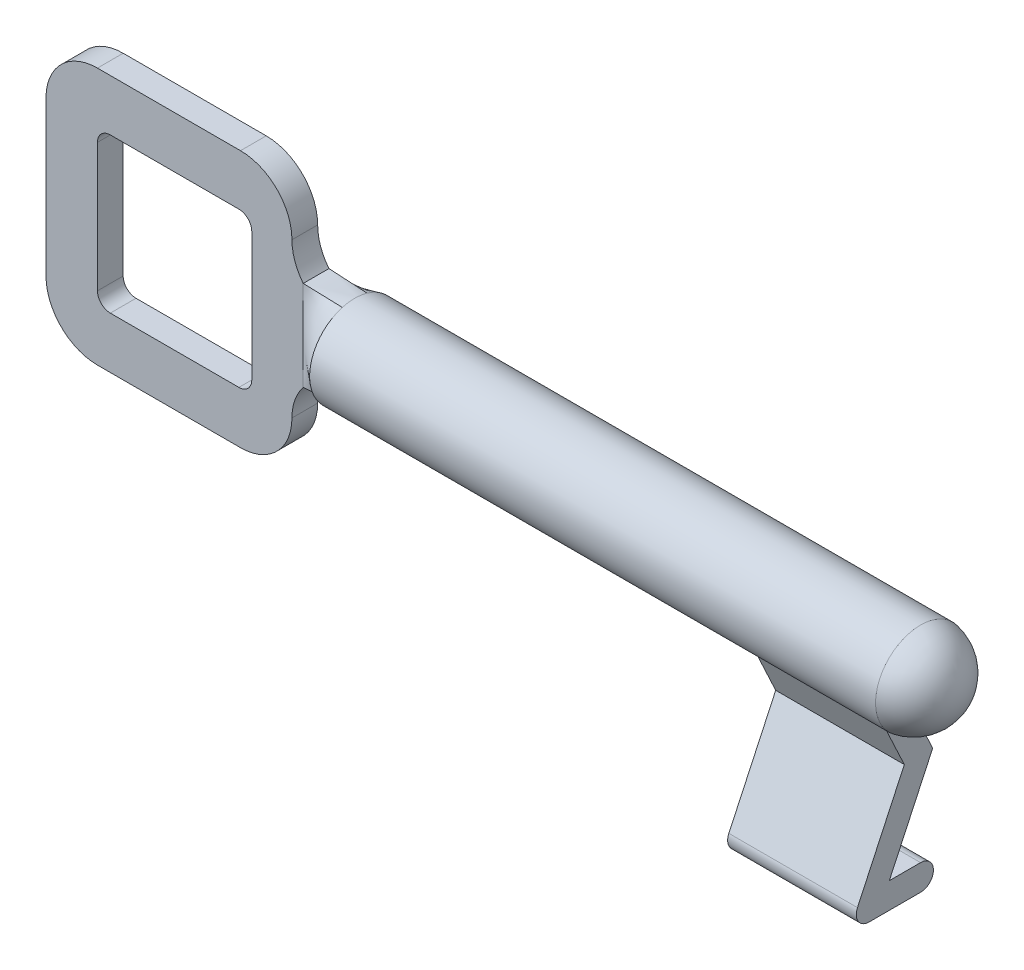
ISO-10303-21;
HEADER;
FILE_DESCRIPTION(('STEP AP214'),'2;1');
FILE_NAME('part.step','',(''),(''),'','','');
FILE_SCHEMA(('AUTOMOTIVE_DESIGN { 1 0 10303 214 1 1 1 1 }'));
ENDSEC;
DATA;
#1=APPLICATION_CONTEXT('core data for automotive mechanical design processes');
#2=APPLICATION_PROTOCOL_DEFINITION('international standard','automotive_design',2000,#1);
#3=PRODUCT_CONTEXT('',#1,'mechanical');
#4=PRODUCT('Part','Part','',(#3));
#5=PRODUCT_RELATED_PRODUCT_CATEGORY('part','',(#4));
#6=PRODUCT_DEFINITION_FORMATION('','',#4);
#7=PRODUCT_DEFINITION_CONTEXT('part definition',#1,'design');
#8=PRODUCT_DEFINITION('design','',#6,#7);
#9=PRODUCT_DEFINITION_SHAPE('','',#8);
#10=(LENGTH_UNIT() NAMED_UNIT(*) SI_UNIT(.MILLI.,.METRE.));
#11=(NAMED_UNIT(*) PLANE_ANGLE_UNIT() SI_UNIT($,.RADIAN.));
#12=(NAMED_UNIT(*) SI_UNIT($,.STERADIAN.) SOLID_ANGLE_UNIT());
#13=UNCERTAINTY_MEASURE_WITH_UNIT(LENGTH_MEASURE(1.E-05),#10,'distance_accuracy_value','');
#14=(GEOMETRIC_REPRESENTATION_CONTEXT(3) GLOBAL_UNCERTAINTY_ASSIGNED_CONTEXT((#13)) GLOBAL_UNIT_ASSIGNED_CONTEXT((#10,
#11,#12)) REPRESENTATION_CONTEXT('',''));
#15=CARTESIAN_POINT('',(0.,0.,0.));
#16=DIRECTION('',(0.,0.,1.));
#17=DIRECTION('',(1.,0.,0.));
#18=AXIS2_PLACEMENT_3D('',#15,#16,#17);
#19=CARTESIAN_POINT('',(4.,6.,1.));
#20=DIRECTION('',(0.,0.,-1.));
#21=DIRECTION('',(-1.,0.,0.));
#22=AXIS2_PLACEMENT_3D('',#19,#20,#21);
#23=PLANE('',#22);
#24=CARTESIAN_POINT('',(4.,6.,1.));
#25=DIRECTION('',(0.,0.,1.));
#26=DIRECTION('',(-1.,0.,0.));
#27=AXIS2_PLACEMENT_3D('',#24,#25,#26);
#28=CIRCLE('',#27,4.);
#29=CARTESIAN_POINT('',(4.,10.,1.));
#30=VERTEX_POINT('',#29);
#31=CARTESIAN_POINT('',(0.,6.,1.));
#32=VERTEX_POINT('',#31);
#33=EDGE_CURVE('E517',#30,#32,#28,.T.);
#34=ORIENTED_EDGE('',*,*,#33,.T.);
#35=DIRECTION('',(0.,-1.,0.));
#36=VECTOR('',#35,1.);
#37=CARTESIAN_POINT('',(0.,6.,1.));
#38=LINE('',#37,#36);
#39=CARTESIAN_POINT('',(0.,-6.,1.));
#40=VERTEX_POINT('',#39);
#41=EDGE_CURVE('E622',#32,#40,#38,.T.);
#42=ORIENTED_EDGE('',*,*,#41,.T.);
#43=CARTESIAN_POINT('',(4.,-6.,1.));
#44=DIRECTION('',(0.,0.,1.));
#45=DIRECTION('',(1.,0.,0.));
#46=AXIS2_PLACEMENT_3D('',#43,#44,#45);
#47=CIRCLE('',#46,4.);
#48=CARTESIAN_POINT('',(4.,-10.,1.));
#49=VERTEX_POINT('',#48);
#50=EDGE_CURVE('E498',#40,#49,#47,.T.);
#51=ORIENTED_EDGE('',*,*,#50,.T.);
#52=DIRECTION('',(1.,0.,0.));
#53=VECTOR('',#52,1.);
#54=CARTESIAN_POINT('',(4.,-10.,1.));
#55=LINE('',#54,#53);
#56=CARTESIAN_POINT('',(15.1224989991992,-10.,1.));
#57=VERTEX_POINT('',#56);
#58=EDGE_CURVE('E624',#49,#57,#55,.T.);
#59=ORIENTED_EDGE('',*,*,#58,.T.);
#60=CARTESIAN_POINT('',(15.1224989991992,-6.,1.));
#61=DIRECTION('',(0.,0.,1.));
#62=DIRECTION('',(1.,0.,0.));
#63=AXIS2_PLACEMENT_3D('',#60,#61,#62);
#64=CIRCLE('',#63,4.);
#65=CARTESIAN_POINT('',(19.1224989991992,-6.,1.));
#66=VERTEX_POINT('',#65);
#67=EDGE_CURVE('E543',#57,#66,#64,.T.);
#68=ORIENTED_EDGE('',*,*,#67,.T.);
#69=CARTESIAN_POINT('',(23.1224989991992,-6.,1.));
#70=DIRECTION('',(0.,0.,-1.));
#71=DIRECTION('',(-1.,0.,0.));
#72=AXIS2_PLACEMENT_3D('',#69,#70,#71);
#73=CIRCLE('',#72,4.);
#74=CARTESIAN_POINT('',(20.,-3.5,1.));
#75=VERTEX_POINT('',#74);
#76=EDGE_CURVE('E540',#66,#75,#73,.T.);
#77=ORIENTED_EDGE('',*,*,#76,.T.);
#78=DIRECTION('',(0.,1.,0.));
#79=VECTOR('',#78,1.);
#80=CARTESIAN_POINT('',(20.,6.,1.));
#81=LINE('',#80,#79);
#82=CARTESIAN_POINT('',(20.,3.5,1.));
#83=VERTEX_POINT('',#82);
#84=EDGE_CURVE('E542',#75,#83,#81,.T.);
#85=ORIENTED_EDGE('',*,*,#84,.T.);
#86=CARTESIAN_POINT('',(23.1224989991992,6.,1.));
#87=DIRECTION('',(0.,0.,-1.));
#88=DIRECTION('',(1.,0.,0.));
#89=AXIS2_PLACEMENT_3D('',#86,#87,#88);
#90=CIRCLE('',#89,4.);
#91=CARTESIAN_POINT('',(19.1224989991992,6.,1.));
#92=VERTEX_POINT('',#91);
#93=EDGE_CURVE('E544',#83,#92,#90,.T.);
#94=ORIENTED_EDGE('',*,*,#93,.T.);
#95=CARTESIAN_POINT('',(15.1224989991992,6.,1.));
#96=DIRECTION('',(0.,0.,1.));
#97=DIRECTION('',(-1.,0.,0.));
#98=AXIS2_PLACEMENT_3D('',#95,#96,#97);
#99=CIRCLE('',#98,4.);
#100=CARTESIAN_POINT('',(15.1224989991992,10.,1.));
#101=VERTEX_POINT('',#100);
#102=EDGE_CURVE('E546',#92,#101,#99,.T.);
#103=ORIENTED_EDGE('',*,*,#102,.T.);
#104=DIRECTION('',(-1.,0.,0.));
#105=VECTOR('',#104,1.);
#106=CARTESIAN_POINT('',(4.,10.,1.));
#107=LINE('',#106,#105);
#108=EDGE_CURVE('E522',#101,#30,#107,.T.);
#109=ORIENTED_EDGE('',*,*,#108,.T.);
#110=EDGE_LOOP('',(#34,#42,#51,#59,#68,#77,#85,#94,#103,#109));
#111=FACE_BOUND('',#110,.T.);
#112=CARTESIAN_POINT('',(5.,-5.,1.));
#113=DIRECTION('',(0.,0.,1.));
#114=DIRECTION('',(-1.,0.,0.));
#115=AXIS2_PLACEMENT_3D('',#112,#113,#114);
#116=CIRCLE('',#115,1.);
#117=CARTESIAN_POINT('',(4.,-5.,1.));
#118=VERTEX_POINT('',#117);
#119=CARTESIAN_POINT('',(5.,-6.,1.));
#120=VERTEX_POINT('',#119);
#121=EDGE_CURVE('E562',#118,#120,#116,.T.);
#122=ORIENTED_EDGE('',*,*,#121,.F.);
#123=DIRECTION('',(0.,-1.,0.));
#124=VECTOR('',#123,1.);
#125=CARTESIAN_POINT('',(4.,-5.,1.));
#126=LINE('',#125,#124);
#127=CARTESIAN_POINT('',(4.,5.,1.));
#128=VERTEX_POINT('',#127);
#129=EDGE_CURVE('E634',#128,#118,#126,.T.);
#130=ORIENTED_EDGE('',*,*,#129,.F.);
#131=CARTESIAN_POINT('',(5.,5.,1.));
#132=DIRECTION('',(0.,0.,1.));
#133=DIRECTION('',(-1.,0.,0.));
#134=AXIS2_PLACEMENT_3D('',#131,#132,#133);
#135=CIRCLE('',#134,1.);
#136=CARTESIAN_POINT('',(5.,6.,1.));
#137=VERTEX_POINT('',#136);
#138=EDGE_CURVE('E687',#137,#128,#135,.T.);
#139=ORIENTED_EDGE('',*,*,#138,.F.);
#140=DIRECTION('',(-1.,0.,0.));
#141=VECTOR('',#140,1.);
#142=CARTESIAN_POINT('',(5.,6.,1.));
#143=LINE('',#142,#141);
#144=CARTESIAN_POINT('',(15.,6.,1.));
#145=VERTEX_POINT('',#144);
#146=EDGE_CURVE('E685',#145,#137,#143,.T.);
#147=ORIENTED_EDGE('',*,*,#146,.F.);
#148=CARTESIAN_POINT('',(15.,5.,1.));
#149=DIRECTION('',(0.,0.,1.));
#150=DIRECTION('',(-1.,0.,0.));
#151=AXIS2_PLACEMENT_3D('',#148,#149,#150);
#152=CIRCLE('',#151,1.);
#153=CARTESIAN_POINT('',(16.,5.,1.));
#154=VERTEX_POINT('',#153);
#155=EDGE_CURVE('E692',#154,#145,#152,.T.);
#156=ORIENTED_EDGE('',*,*,#155,.F.);
#157=DIRECTION('',(0.,1.,0.));
#158=VECTOR('',#157,1.);
#159=CARTESIAN_POINT('',(16.,5.,1.));
#160=LINE('',#159,#158);
#161=CARTESIAN_POINT('',(16.,-5.,1.));
#162=VERTEX_POINT('',#161);
#163=EDGE_CURVE('E694',#162,#154,#160,.T.);
#164=ORIENTED_EDGE('',*,*,#163,.F.);
#165=CARTESIAN_POINT('',(15.,-5.,1.));
#166=DIRECTION('',(0.,0.,1.));
#167=DIRECTION('',(-1.,0.,0.));
#168=AXIS2_PLACEMENT_3D('',#165,#166,#167);
#169=CIRCLE('',#168,1.);
#170=CARTESIAN_POINT('',(15.,-6.,1.));
#171=VERTEX_POINT('',#170);
#172=EDGE_CURVE('E639',#171,#162,#169,.T.);
#173=ORIENTED_EDGE('',*,*,#172,.F.);
#174=DIRECTION('',(1.,0.,0.));
#175=VECTOR('',#174,1.);
#176=CARTESIAN_POINT('',(5.,-6.,1.));
#177=LINE('',#176,#175);
#178=EDGE_CURVE('E636',#120,#171,#177,.T.);
#179=ORIENTED_EDGE('',*,*,#178,.F.);
#180=EDGE_LOOP('',(#122,#130,#139,#147,#156,#164,#173,#179));
#181=FACE_BOUND('',#180,.T.);
#182=ADVANCED_FACE('F59',(#111,#181),#23,.F.);
#183=CARTESIAN_POINT('',(4.,6.,-1.));
#184=DIRECTION('',(0.,0.,-1.));
#185=DIRECTION('',(-1.,0.,0.));
#186=AXIS2_PLACEMENT_3D('',#183,#184,#185);
#187=PLANE('',#186);
#188=CARTESIAN_POINT('',(4.,6.,-1.));
#189=DIRECTION('',(0.,0.,1.));
#190=DIRECTION('',(-1.,0.,0.));
#191=AXIS2_PLACEMENT_3D('',#188,#189,#190);
#192=CIRCLE('',#191,4.);
#193=CARTESIAN_POINT('',(4.,10.,-1.));
#194=VERTEX_POINT('',#193);
#195=CARTESIAN_POINT('',(0.,6.,-1.));
#196=VERTEX_POINT('',#195);
#197=EDGE_CURVE('E494',#194,#196,#192,.T.);
#198=ORIENTED_EDGE('',*,*,#197,.F.);
#199=DIRECTION('',(-1.,0.,0.));
#200=VECTOR('',#199,1.);
#201=CARTESIAN_POINT('',(4.,10.,-1.));
#202=LINE('',#201,#200);
#203=CARTESIAN_POINT('',(15.1224989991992,10.,-1.));
#204=VERTEX_POINT('',#203);
#205=EDGE_CURVE('E514',#204,#194,#202,.T.);
#206=ORIENTED_EDGE('',*,*,#205,.F.);
#207=CARTESIAN_POINT('',(15.1224989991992,6.,-1.));
#208=DIRECTION('',(0.,0.,1.));
#209=DIRECTION('',(-1.,0.,0.));
#210=AXIS2_PLACEMENT_3D('',#207,#208,#209);
#211=CIRCLE('',#210,4.);
#212=CARTESIAN_POINT('',(19.1224989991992,6.,-1.));
#213=VERTEX_POINT('',#212);
#214=EDGE_CURVE('E512',#213,#204,#211,.T.);
#215=ORIENTED_EDGE('',*,*,#214,.F.);
#216=CARTESIAN_POINT('',(23.1224989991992,6.,-1.));
#217=DIRECTION('',(0.,0.,-1.));
#218=DIRECTION('',(1.,0.,0.));
#219=AXIS2_PLACEMENT_3D('',#216,#217,#218);
#220=CIRCLE('',#219,4.);
#221=CARTESIAN_POINT('',(20.,3.5,-1.));
#222=VERTEX_POINT('',#221);
#223=EDGE_CURVE('E515',#222,#213,#220,.T.);
#224=ORIENTED_EDGE('',*,*,#223,.F.);
#225=DIRECTION('',(0.,1.,0.));
#226=VECTOR('',#225,1.);
#227=CARTESIAN_POINT('',(20.,6.,-1.));
#228=LINE('',#227,#226);
#229=CARTESIAN_POINT('',(20.,-3.5,-1.));
#230=VERTEX_POINT('',#229);
#231=EDGE_CURVE('E539',#230,#222,#228,.T.);
#232=ORIENTED_EDGE('',*,*,#231,.F.);
#233=CARTESIAN_POINT('',(23.1224989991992,-6.,-1.));
#234=DIRECTION('',(0.,0.,-1.));
#235=DIRECTION('',(-1.,0.,0.));
#236=AXIS2_PLACEMENT_3D('',#233,#234,#235);
#237=CIRCLE('',#236,4.);
#238=CARTESIAN_POINT('',(19.1224989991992,-6.,-1.));
#239=VERTEX_POINT('',#238);
#240=EDGE_CURVE('E511',#239,#230,#237,.T.);
#241=ORIENTED_EDGE('',*,*,#240,.F.);
#242=CARTESIAN_POINT('',(15.1224989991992,-6.,-1.));
#243=DIRECTION('',(0.,0.,1.));
#244=DIRECTION('',(1.,0.,0.));
#245=AXIS2_PLACEMENT_3D('',#242,#243,#244);
#246=CIRCLE('',#245,4.);
#247=CARTESIAN_POINT('',(15.1224989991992,-10.,-1.));
#248=VERTEX_POINT('',#247);
#249=EDGE_CURVE('E506',#248,#239,#246,.T.);
#250=ORIENTED_EDGE('',*,*,#249,.F.);
#251=DIRECTION('',(1.,0.,0.));
#252=VECTOR('',#251,1.);
#253=CARTESIAN_POINT('',(4.,-10.,-1.));
#254=LINE('',#253,#252);
#255=CARTESIAN_POINT('',(4.,-10.,-1.));
#256=VERTEX_POINT('',#255);
#257=EDGE_CURVE('E504',#256,#248,#254,.T.);
#258=ORIENTED_EDGE('',*,*,#257,.F.);
#259=CARTESIAN_POINT('',(4.,-6.,-1.));
#260=DIRECTION('',(0.,0.,1.));
#261=DIRECTION('',(1.,0.,0.));
#262=AXIS2_PLACEMENT_3D('',#259,#260,#261);
#263=CIRCLE('',#262,4.);
#264=CARTESIAN_POINT('',(0.,-6.,-1.));
#265=VERTEX_POINT('',#264);
#266=EDGE_CURVE('E493',#265,#256,#263,.T.);
#267=ORIENTED_EDGE('',*,*,#266,.F.);
#268=DIRECTION('',(0.,-1.,0.));
#269=VECTOR('',#268,1.);
#270=CARTESIAN_POINT('',(0.,6.,-1.));
#271=LINE('',#270,#269);
#272=EDGE_CURVE('E486',#196,#265,#271,.T.);
#273=ORIENTED_EDGE('',*,*,#272,.F.);
#274=EDGE_LOOP('',(#198,#206,#215,#224,#232,#241,#250,#258,#267,#273));
#275=FACE_BOUND('',#274,.T.);
#276=DIRECTION('',(0.,-1.,0.));
#277=VECTOR('',#276,1.);
#278=CARTESIAN_POINT('',(4.,-5.,-1.));
#279=LINE('',#278,#277);
#280=CARTESIAN_POINT('',(4.,5.,-1.));
#281=VERTEX_POINT('',#280);
#282=CARTESIAN_POINT('',(4.,-5.,-1.));
#283=VERTEX_POINT('',#282);
#284=EDGE_CURVE('E638',#281,#283,#279,.T.);
#285=ORIENTED_EDGE('',*,*,#284,.T.);
#286=CARTESIAN_POINT('',(5.,-5.,-1.));
#287=DIRECTION('',(0.,0.,1.));
#288=DIRECTION('',(-1.,0.,0.));
#289=AXIS2_PLACEMENT_3D('',#286,#287,#288);
#290=CIRCLE('',#289,1.);
#291=CARTESIAN_POINT('',(5.,-6.,-1.));
#292=VERTEX_POINT('',#291);
#293=EDGE_CURVE('E586',#283,#292,#290,.T.);
#294=ORIENTED_EDGE('',*,*,#293,.T.);
#295=DIRECTION('',(1.,0.,0.));
#296=VECTOR('',#295,1.);
#297=CARTESIAN_POINT('',(5.,-6.,-1.));
#298=LINE('',#297,#296);
#299=CARTESIAN_POINT('',(15.,-6.,-1.));
#300=VERTEX_POINT('',#299);
#301=EDGE_CURVE('E674',#292,#300,#298,.T.);
#302=ORIENTED_EDGE('',*,*,#301,.T.);
#303=CARTESIAN_POINT('',(15.,-5.,-1.));
#304=DIRECTION('',(0.,0.,1.));
#305=DIRECTION('',(-1.,0.,0.));
#306=AXIS2_PLACEMENT_3D('',#303,#304,#305);
#307=CIRCLE('',#306,1.);
#308=CARTESIAN_POINT('',(16.,-5.,-1.));
#309=VERTEX_POINT('',#308);
#310=EDGE_CURVE('E664',#300,#309,#307,.T.);
#311=ORIENTED_EDGE('',*,*,#310,.T.);
#312=DIRECTION('',(0.,1.,0.));
#313=VECTOR('',#312,1.);
#314=CARTESIAN_POINT('',(16.,5.,-1.));
#315=LINE('',#314,#313);
#316=CARTESIAN_POINT('',(16.,5.,-1.));
#317=VERTEX_POINT('',#316);
#318=EDGE_CURVE('E668',#309,#317,#315,.T.);
#319=ORIENTED_EDGE('',*,*,#318,.T.);
#320=CARTESIAN_POINT('',(15.,5.,-1.));
#321=DIRECTION('',(0.,0.,1.));
#322=DIRECTION('',(-1.,0.,0.));
#323=AXIS2_PLACEMENT_3D('',#320,#321,#322);
#324=CIRCLE('',#323,1.);
#325=CARTESIAN_POINT('',(15.,6.,-1.));
#326=VERTEX_POINT('',#325);
#327=EDGE_CURVE('E672',#317,#326,#324,.T.);
#328=ORIENTED_EDGE('',*,*,#327,.T.);
#329=DIRECTION('',(-1.,0.,0.));
#330=VECTOR('',#329,1.);
#331=CARTESIAN_POINT('',(5.,6.,-1.));
#332=LINE('',#331,#330);
#333=CARTESIAN_POINT('',(5.,6.,-1.));
#334=VERTEX_POINT('',#333);
#335=EDGE_CURVE('E645',#326,#334,#332,.T.);
#336=ORIENTED_EDGE('',*,*,#335,.T.);
#337=CARTESIAN_POINT('',(5.,5.,-1.));
#338=DIRECTION('',(0.,0.,1.));
#339=DIRECTION('',(-1.,0.,0.));
#340=AXIS2_PLACEMENT_3D('',#337,#338,#339);
#341=CIRCLE('',#340,1.);
#342=EDGE_CURVE('E641',#334,#281,#341,.T.);
#343=ORIENTED_EDGE('',*,*,#342,.T.);
#344=EDGE_LOOP('',(#285,#294,#302,#311,#319,#328,#336,#343));
#345=FACE_BOUND('',#344,.T.);
#346=ADVANCED_FACE('F447',(#275,#345),#187,.T.);
#347=CARTESIAN_POINT('',(4.,6.,1.));
#348=DIRECTION('',(0.,0.,-1.));
#349=DIRECTION('',(-1.,0.,0.));
#350=AXIS2_PLACEMENT_3D('',#347,#348,#349);
#351=CYLINDRICAL_SURFACE('',#350,4.);
#352=ORIENTED_EDGE('',*,*,#197,.T.);
#353=DIRECTION('',(0.,0.,-1.));
#354=VECTOR('',#353,1.);
#355=CARTESIAN_POINT('',(0.,6.,1.));
#356=LINE('',#355,#354);
#357=EDGE_CURVE('E12',#32,#196,#356,.T.);
#358=ORIENTED_EDGE('',*,*,#357,.F.);
#359=ORIENTED_EDGE('',*,*,#33,.F.);
#360=DIRECTION('',(0.,0.,-1.));
#361=VECTOR('',#360,1.);
#362=CARTESIAN_POINT('',(4.,10.,1.));
#363=LINE('',#362,#361);
#364=EDGE_CURVE('E518',#30,#194,#363,.T.);
#365=ORIENTED_EDGE('',*,*,#364,.T.);
#366=EDGE_LOOP('',(#352,#358,#359,#365));
#367=FACE_BOUND('',#366,.T.);
#368=ADVANCED_FACE('F61',(#367),#351,.T.);
#369=CARTESIAN_POINT('',(0.,6.,1.));
#370=DIRECTION('',(1.,0.,0.));
#371=DIRECTION('',(0.,0.,-1.));
#372=AXIS2_PLACEMENT_3D('',#369,#370,#371);
#373=PLANE('',#372);
#374=ORIENTED_EDGE('',*,*,#272,.T.);
#375=DIRECTION('',(0.,0.,-1.));
#376=VECTOR('',#375,1.);
#377=CARTESIAN_POINT('',(0.,-6.,1.));
#378=LINE('',#377,#376);
#379=EDGE_CURVE('E69',#40,#265,#378,.T.);
#380=ORIENTED_EDGE('',*,*,#379,.F.);
#381=ORIENTED_EDGE('',*,*,#41,.F.);
#382=ORIENTED_EDGE('',*,*,#357,.T.);
#383=EDGE_LOOP('',(#374,#380,#381,#382));
#384=FACE_BOUND('',#383,.T.);
#385=ADVANCED_FACE('F477',(#384),#373,.F.);
#386=CARTESIAN_POINT('',(4.,-6.,1.));
#387=DIRECTION('',(0.,0.,-1.));
#388=DIRECTION('',(-1.,0.,0.));
#389=AXIS2_PLACEMENT_3D('',#386,#387,#388);
#390=CYLINDRICAL_SURFACE('',#389,4.);
#391=ORIENTED_EDGE('',*,*,#266,.T.);
#392=DIRECTION('',(0.,0.,-1.));
#393=VECTOR('',#392,1.);
#394=CARTESIAN_POINT('',(4.,-10.,1.));
#395=LINE('',#394,#393);
#396=EDGE_CURVE('E499',#49,#256,#395,.T.);
#397=ORIENTED_EDGE('',*,*,#396,.F.);
#398=ORIENTED_EDGE('',*,*,#50,.F.);
#399=ORIENTED_EDGE('',*,*,#379,.T.);
#400=EDGE_LOOP('',(#391,#397,#398,#399));
#401=FACE_BOUND('',#400,.T.);
#402=ADVANCED_FACE('F474',(#401),#390,.T.);
#403=CARTESIAN_POINT('',(4.,-10.,1.));
#404=DIRECTION('',(0.,1.,0.));
#405=DIRECTION('',(-1.,0.,0.));
#406=AXIS2_PLACEMENT_3D('',#403,#404,#405);
#407=PLANE('',#406);
#408=ORIENTED_EDGE('',*,*,#257,.T.);
#409=DIRECTION('',(0.,0.,-1.));
#410=VECTOR('',#409,1.);
#411=CARTESIAN_POINT('',(15.1224989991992,-10.,1.));
#412=LINE('',#411,#410);
#413=EDGE_CURVE('E532',#57,#248,#412,.T.);
#414=ORIENTED_EDGE('',*,*,#413,.F.);
#415=ORIENTED_EDGE('',*,*,#58,.F.);
#416=ORIENTED_EDGE('',*,*,#396,.T.);
#417=EDGE_LOOP('',(#408,#414,#415,#416));
#418=FACE_BOUND('',#417,.T.);
#419=ADVANCED_FACE('F470',(#418),#407,.F.);
#420=CARTESIAN_POINT('',(15.1224989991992,-6.,1.));
#421=DIRECTION('',(0.,0.,-1.));
#422=DIRECTION('',(-1.,0.,0.));
#423=AXIS2_PLACEMENT_3D('',#420,#421,#422);
#424=CYLINDRICAL_SURFACE('',#423,4.);
#425=ORIENTED_EDGE('',*,*,#249,.T.);
#426=DIRECTION('',(0.,0.,-1.));
#427=VECTOR('',#426,1.);
#428=CARTESIAN_POINT('',(19.1224989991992,-6.,1.));
#429=LINE('',#428,#427);
#430=EDGE_CURVE('E529',#66,#239,#429,.T.);
#431=ORIENTED_EDGE('',*,*,#430,.F.);
#432=ORIENTED_EDGE('',*,*,#67,.F.);
#433=ORIENTED_EDGE('',*,*,#413,.T.);
#434=EDGE_LOOP('',(#425,#431,#432,#433));
#435=FACE_BOUND('',#434,.T.);
#436=ADVANCED_FACE('F466',(#435),#424,.T.);
#437=CARTESIAN_POINT('',(23.1224989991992,-6.,1.));
#438=DIRECTION('',(0.,0.,-1.));
#439=DIRECTION('',(-1.,0.,0.));
#440=AXIS2_PLACEMENT_3D('',#437,#438,#439);
#441=CYLINDRICAL_SURFACE('',#440,4.);
#442=ORIENTED_EDGE('',*,*,#240,.T.);
#443=DIRECTION('',(0.,0.,-1.));
#444=VECTOR('',#443,1.);
#445=CARTESIAN_POINT('',(20.,-3.5,1.));
#446=LINE('',#445,#444);
#447=EDGE_CURVE('E533',#75,#230,#446,.T.);
#448=ORIENTED_EDGE('',*,*,#447,.F.);
#449=ORIENTED_EDGE('',*,*,#76,.F.);
#450=ORIENTED_EDGE('',*,*,#430,.T.);
#451=EDGE_LOOP('',(#442,#448,#449,#450));
#452=FACE_BOUND('',#451,.T.);
#453=ADVANCED_FACE('F462',(#452),#441,.F.);
#454=CARTESIAN_POINT('',(23.1224989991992,6.,1.));
#455=DIRECTION('',(0.,0.,-1.));
#456=DIRECTION('',(-1.,0.,0.));
#457=AXIS2_PLACEMENT_3D('',#454,#455,#456);
#458=CYLINDRICAL_SURFACE('',#457,4.);
#459=ORIENTED_EDGE('',*,*,#223,.T.);
#460=DIRECTION('',(0.,0.,-1.));
#461=VECTOR('',#460,1.);
#462=CARTESIAN_POINT('',(19.1224989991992,6.,1.));
#463=LINE('',#462,#461);
#464=EDGE_CURVE('E525',#92,#213,#463,.T.);
#465=ORIENTED_EDGE('',*,*,#464,.F.);
#466=ORIENTED_EDGE('',*,*,#93,.F.);
#467=DIRECTION('',(0.,0.,-1.));
#468=VECTOR('',#467,1.);
#469=CARTESIAN_POINT('',(20.,3.5,1.));
#470=LINE('',#469,#468);
#471=EDGE_CURVE('E528',#83,#222,#470,.T.);
#472=ORIENTED_EDGE('',*,*,#471,.T.);
#473=EDGE_LOOP('',(#459,#465,#466,#472));
#474=FACE_BOUND('',#473,.T.);
#475=ADVANCED_FACE('F458',(#474),#458,.F.);
#476=CARTESIAN_POINT('',(15.1224989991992,6.,1.));
#477=DIRECTION('',(0.,0.,-1.));
#478=DIRECTION('',(-1.,0.,0.));
#479=AXIS2_PLACEMENT_3D('',#476,#477,#478);
#480=CYLINDRICAL_SURFACE('',#479,4.);
#481=ORIENTED_EDGE('',*,*,#214,.T.);
#482=DIRECTION('',(0.,0.,-1.));
#483=VECTOR('',#482,1.);
#484=CARTESIAN_POINT('',(15.1224989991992,10.,1.));
#485=LINE('',#484,#483);
#486=EDGE_CURVE('E521',#101,#204,#485,.T.);
#487=ORIENTED_EDGE('',*,*,#486,.F.);
#488=ORIENTED_EDGE('',*,*,#102,.F.);
#489=ORIENTED_EDGE('',*,*,#464,.T.);
#490=EDGE_LOOP('',(#481,#487,#488,#489));
#491=FACE_BOUND('',#490,.T.);
#492=ADVANCED_FACE('F454',(#491),#480,.T.);
#493=CARTESIAN_POINT('',(4.,10.,1.));
#494=DIRECTION('',(0.,-1.,0.));
#495=DIRECTION('',(1.,0.,0.));
#496=AXIS2_PLACEMENT_3D('',#493,#494,#495);
#497=PLANE('',#496);
#498=ORIENTED_EDGE('',*,*,#205,.T.);
#499=ORIENTED_EDGE('',*,*,#364,.F.);
#500=ORIENTED_EDGE('',*,*,#108,.F.);
#501=ORIENTED_EDGE('',*,*,#486,.T.);
#502=EDGE_LOOP('',(#498,#499,#500,#501));
#503=FACE_BOUND('',#502,.T.);
#504=ADVANCED_FACE('F443',(#503),#497,.F.);
#505=CARTESIAN_POINT('',(5.,-5.,1.));
#506=DIRECTION('',(0.,0.,-1.));
#507=DIRECTION('',(-1.,0.,0.));
#508=AXIS2_PLACEMENT_3D('',#505,#506,#507);
#509=CYLINDRICAL_SURFACE('',#508,1.);
#510=ORIENTED_EDGE('',*,*,#293,.F.);
#511=DIRECTION('',(0.,0.,-1.));
#512=VECTOR('',#511,1.);
#513=CARTESIAN_POINT('',(4.,-5.,1.));
#514=LINE('',#513,#512);
#515=EDGE_CURVE('E649',#118,#283,#514,.T.);
#516=ORIENTED_EDGE('',*,*,#515,.F.);
#517=ORIENTED_EDGE('',*,*,#121,.T.);
#518=DIRECTION('',(0.,0.,-1.));
#519=VECTOR('',#518,1.);
#520=CARTESIAN_POINT('',(5.,-6.,1.));
#521=LINE('',#520,#519);
#522=EDGE_CURVE('E610',#120,#292,#521,.T.);
#523=ORIENTED_EDGE('',*,*,#522,.T.);
#524=EDGE_LOOP('',(#510,#516,#517,#523));
#525=FACE_BOUND('',#524,.T.);
#526=ADVANCED_FACE('F439',(#525),#509,.F.);
#527=CARTESIAN_POINT('',(5.,-6.,1.));
#528=DIRECTION('',(0.,1.,0.));
#529=DIRECTION('',(0.,0.,1.));
#530=AXIS2_PLACEMENT_3D('',#527,#528,#529);
#531=PLANE('',#530);
#532=ORIENTED_EDGE('',*,*,#301,.F.);
#533=ORIENTED_EDGE('',*,*,#522,.F.);
#534=ORIENTED_EDGE('',*,*,#178,.T.);
#535=DIRECTION('',(0.,0.,-1.));
#536=VECTOR('',#535,1.);
#537=CARTESIAN_POINT('',(15.,-6.,1.));
#538=LINE('',#537,#536);
#539=EDGE_CURVE('E612',#171,#300,#538,.T.);
#540=ORIENTED_EDGE('',*,*,#539,.T.);
#541=EDGE_LOOP('',(#532,#533,#534,#540));
#542=FACE_BOUND('',#541,.T.);
#543=ADVANCED_FACE('F435',(#542),#531,.T.);
#544=CARTESIAN_POINT('',(15.,-5.,1.));
#545=DIRECTION('',(0.,0.,-1.));
#546=DIRECTION('',(-1.,0.,0.));
#547=AXIS2_PLACEMENT_3D('',#544,#545,#546);
#548=CYLINDRICAL_SURFACE('',#547,1.);
#549=ORIENTED_EDGE('',*,*,#310,.F.);
#550=ORIENTED_EDGE('',*,*,#539,.F.);
#551=ORIENTED_EDGE('',*,*,#172,.T.);
#552=DIRECTION('',(0.,0.,-1.));
#553=VECTOR('',#552,1.);
#554=CARTESIAN_POINT('',(16.,-5.,1.));
#555=LINE('',#554,#553);
#556=EDGE_CURVE('E616',#162,#309,#555,.T.);
#557=ORIENTED_EDGE('',*,*,#556,.T.);
#558=EDGE_LOOP('',(#549,#550,#551,#557));
#559=FACE_BOUND('',#558,.T.);
#560=ADVANCED_FACE('F431',(#559),#548,.F.);
#561=CARTESIAN_POINT('',(16.,5.,1.));
#562=DIRECTION('',(-1.,0.,0.));
#563=DIRECTION('',(0.,0.,1.));
#564=AXIS2_PLACEMENT_3D('',#561,#562,#563);
#565=PLANE('',#564);
#566=ORIENTED_EDGE('',*,*,#318,.F.);
#567=ORIENTED_EDGE('',*,*,#556,.F.);
#568=ORIENTED_EDGE('',*,*,#163,.T.);
#569=DIRECTION('',(0.,0.,-1.));
#570=VECTOR('',#569,1.);
#571=CARTESIAN_POINT('',(16.,5.,1.));
#572=LINE('',#571,#570);
#573=EDGE_CURVE('E658',#154,#317,#572,.T.);
#574=ORIENTED_EDGE('',*,*,#573,.T.);
#575=EDGE_LOOP('',(#566,#567,#568,#574));
#576=FACE_BOUND('',#575,.T.);
#577=ADVANCED_FACE('F427',(#576),#565,.T.);
#578=CARTESIAN_POINT('',(15.,5.,1.));
#579=DIRECTION('',(0.,0.,-1.));
#580=DIRECTION('',(-1.,0.,0.));
#581=AXIS2_PLACEMENT_3D('',#578,#579,#580);
#582=CYLINDRICAL_SURFACE('',#581,1.);
#583=ORIENTED_EDGE('',*,*,#327,.F.);
#584=ORIENTED_EDGE('',*,*,#573,.F.);
#585=ORIENTED_EDGE('',*,*,#155,.T.);
#586=DIRECTION('',(0.,0.,-1.));
#587=VECTOR('',#586,1.);
#588=CARTESIAN_POINT('',(15.,6.,1.));
#589=LINE('',#588,#587);
#590=EDGE_CURVE('E656',#145,#326,#589,.T.);
#591=ORIENTED_EDGE('',*,*,#590,.T.);
#592=EDGE_LOOP('',(#583,#584,#585,#591));
#593=FACE_BOUND('',#592,.T.);
#594=ADVANCED_FACE('F423',(#593),#582,.F.);
#595=CARTESIAN_POINT('',(5.,6.,1.));
#596=DIRECTION('',(0.,-1.,0.));
#597=DIRECTION('',(0.,0.,-1.));
#598=AXIS2_PLACEMENT_3D('',#595,#596,#597);
#599=PLANE('',#598);
#600=ORIENTED_EDGE('',*,*,#335,.F.);
#601=ORIENTED_EDGE('',*,*,#590,.F.);
#602=ORIENTED_EDGE('',*,*,#146,.T.);
#603=DIRECTION('',(0.,0.,-1.));
#604=VECTOR('',#603,1.);
#605=CARTESIAN_POINT('',(5.,6.,1.));
#606=LINE('',#605,#604);
#607=EDGE_CURVE('E654',#137,#334,#606,.T.);
#608=ORIENTED_EDGE('',*,*,#607,.T.);
#609=EDGE_LOOP('',(#600,#601,#602,#608));
#610=FACE_BOUND('',#609,.T.);
#611=ADVANCED_FACE('F419',(#610),#599,.T.);
#612=CARTESIAN_POINT('',(5.,5.,1.));
#613=DIRECTION('',(0.,0.,-1.));
#614=DIRECTION('',(-1.,0.,0.));
#615=AXIS2_PLACEMENT_3D('',#612,#613,#614);
#616=CYLINDRICAL_SURFACE('',#615,1.);
#617=ORIENTED_EDGE('',*,*,#342,.F.);
#618=ORIENTED_EDGE('',*,*,#607,.F.);
#619=ORIENTED_EDGE('',*,*,#138,.T.);
#620=DIRECTION('',(0.,0.,-1.));
#621=VECTOR('',#620,1.);
#622=CARTESIAN_POINT('',(4.,5.,1.));
#623=LINE('',#622,#621);
#624=EDGE_CURVE('E652',#128,#281,#623,.T.);
#625=ORIENTED_EDGE('',*,*,#624,.T.);
#626=EDGE_LOOP('',(#617,#618,#619,#625));
#627=FACE_BOUND('',#626,.T.);
#628=ADVANCED_FACE('F415',(#627),#616,.F.);
#629=CARTESIAN_POINT('',(4.,-5.,1.));
#630=DIRECTION('',(1.,0.,0.));
#631=DIRECTION('',(0.,0.,-1.));
#632=AXIS2_PLACEMENT_3D('',#629,#630,#631);
#633=PLANE('',#632);
#634=ORIENTED_EDGE('',*,*,#284,.F.);
#635=ORIENTED_EDGE('',*,*,#624,.F.);
#636=ORIENTED_EDGE('',*,*,#129,.T.);
#637=ORIENTED_EDGE('',*,*,#515,.T.);
#638=EDGE_LOOP('',(#634,#635,#636,#637));
#639=FACE_BOUND('',#638,.T.);
#640=ADVANCED_FACE('F362',(#639),#633,.T.);
#641=CARTESIAN_POINT('',(20.,-3.5,-1.));
#642=CARTESIAN_POINT('',(23.,-3.36533381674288,-0.961523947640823));
#643=CARTESIAN_POINT('',(20.,-3.20833333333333,-1.));
#644=CARTESIAN_POINT('',(23.,-3.28828979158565,-1.23117803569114));
#645=CARTESIAN_POINT('',(20.,-2.91666666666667,-1.));
#646=CARTESIAN_POINT('',(23.,-3.17165512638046,-1.5171393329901));
#647=CARTESIAN_POINT('',(20.,-2.33333333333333,-1.));
#648=CARTESIAN_POINT('',(23.,-2.82826077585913,-2.0885518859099));
#649=CARTESIAN_POINT('',(20.,-2.04166666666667,-1.));
#650=CARTESIAN_POINT('',(23.,-2.60056481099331,-2.37391098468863));
#651=CARTESIAN_POINT('',(20.,-1.45833333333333,-1.));
#652=CARTESIAN_POINT('',(23.,-2.02201679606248,-2.88267909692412));
#653=CARTESIAN_POINT('',(20.,-1.16666666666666,-1.));
#654=CARTESIAN_POINT('',(23.,-1.67041611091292,-3.10487512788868));
#655=CARTESIAN_POINT('',(20.,-0.583333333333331,-1.));
#656=CARTESIAN_POINT('',(23.,-0.878980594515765,-3.41437148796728));
#657=CARTESIAN_POINT('',(20.,-0.291666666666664,-1.));
#658=CARTESIAN_POINT('',(23.,-0.440009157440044,-3.5));
#659=CARTESIAN_POINT('',(20.,0.291666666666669,-1.));
#660=CARTESIAN_POINT('',(23.,0.440009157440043,-3.5));
#661=CARTESIAN_POINT('',(20.,0.583333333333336,-1.));
#662=CARTESIAN_POINT('',(23.,0.878980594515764,-3.41437148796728));
#663=CARTESIAN_POINT('',(20.,1.16666666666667,-1.));
#664=CARTESIAN_POINT('',(23.,1.67041611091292,-3.10487512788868));
#665=CARTESIAN_POINT('',(20.,1.45833333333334,-1.));
#666=CARTESIAN_POINT('',(23.,2.02201679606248,-2.88267909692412));
#667=CARTESIAN_POINT('',(20.,2.04166666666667,-1.));
#668=CARTESIAN_POINT('',(23.,2.60056481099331,-2.37391098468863));
#669=CARTESIAN_POINT('',(20.,2.33333333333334,-1.));
#670=CARTESIAN_POINT('',(23.,2.82826077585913,-2.0885518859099));
#671=CARTESIAN_POINT('',(20.,2.91666666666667,-1.));
#672=CARTESIAN_POINT('',(23.,3.17165512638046,-1.5171393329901));
#673=CARTESIAN_POINT('',(20.,3.20833333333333,-1.));
#674=CARTESIAN_POINT('',(23.,3.28828979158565,-1.23117803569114));
#675=CARTESIAN_POINT('',(20.,3.5,-1.));
#676=CARTESIAN_POINT('',(23.,3.36533381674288,-0.961523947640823));
#677=B_SPLINE_SURFACE_WITH_KNOTS('',3,1,((#641,#642),(#643,#644),(#645,#646),(#647,#648),(#649,
#650),(#651,#652),(#653,#654),(#655,#656),(#657,#658),(#659,#660),(#661,#662),(#663,#664),(#665,
#666),(#667,#668),(#669,#670),(#671,#672),(#673,#674),(#675,#676)),.UNSPECIFIED.,.F.,.F.,.F.,(4,
2,2,2,2,2,2,2,4),(2,2),(0.,0.125,0.25,0.375,0.5,0.625,0.75,0.875,1.),(0.,1.),.UNSPECIFIED.);
#678=DIRECTION('',(0.998912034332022,-0.0448398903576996,0.012811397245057));
#679=VECTOR('',#678,1.);
#680=CARTESIAN_POINT('',(21.5,3.43266690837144,-0.980761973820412));
#681=LINE('',#680,#679);
#682=CARTESIAN_POINT('',(23.,3.36553601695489,-0.961582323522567));
#683=VERTEX_POINT('',#682);
#684=EDGE_CURVE('E581',#222,#683,#681,.T.);
#685=CARTESIAN_POINT('',(23.,0.,0.));
#686=DIRECTION('',(1.,0.,0.));
#687=DIRECTION('',(0.,0.,-1.));
#688=AXIS2_PLACEMENT_3D('',#685,#686,#687);
#689=CIRCLE('',#688,3.5);
#690=CARTESIAN_POINT('',(23.,-3.3655612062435,-0.96158954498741));
#691=VERTEX_POINT('',#690);
#692=EDGE_CURVE('E325',#691,#683,#689,.T.);
#693=DIRECTION('',(-0.998912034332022,-0.0448398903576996,-0.012811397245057));
#694=VECTOR('',#693,1.);
#695=CARTESIAN_POINT('',(21.5,-3.43266690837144,-0.980761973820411));
#696=LINE('',#695,#694);
#697=EDGE_CURVE('E578',#691,#230,#696,.T.);
#698=ORIENTED_EDGE('',*,*,#231,.T.);
#699=ORIENTED_EDGE('',*,*,#684,.T.);
#700=ORIENTED_EDGE('',*,*,#692,.F.);
#701=ORIENTED_EDGE('',*,*,#697,.T.);
#702=EDGE_LOOP('',(#698,#699,#700,#701));
#703=FACE_BOUND('',#702,.T.);
#704=ADVANCED_FACE('F351',(#703),#677,.T.);
#705=CARTESIAN_POINT('',(20.,3.5,-1.));
#706=CARTESIAN_POINT('',(23.,3.36533381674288,-0.961523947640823));
#707=CARTESIAN_POINT('',(20.,3.5,-0.666666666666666));
#708=CARTESIAN_POINT('',(23.,3.45338413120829,-0.653347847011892));
#709=CARTESIAN_POINT('',(20.,3.5,-0.333333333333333));
#710=CARTESIAN_POINT('',(23.,3.5,-0.326794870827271));
#711=CARTESIAN_POINT('',(20.,3.5,0.333333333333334));
#712=CARTESIAN_POINT('',(23.,3.5,0.326794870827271));
#713=CARTESIAN_POINT('',(20.,3.5,0.666666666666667));
#714=CARTESIAN_POINT('',(23.,3.45338413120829,0.653347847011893));
#715=CARTESIAN_POINT('',(20.,3.5,1.));
#716=CARTESIAN_POINT('',(23.,3.36533381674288,0.961523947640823));
#717=B_SPLINE_SURFACE_WITH_KNOTS('',3,1,((#705,#706),(#707,#708),(#709,#710),(#711,#712),(#713,
#714),(#715,#716)),.UNSPECIFIED.,.F.,.F.,.F.,(4,2,4),(2,2),(0.,0.5,1.),(0.,1.),.UNSPECIFIED.);
#718=DIRECTION('',(0.998912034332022,-0.0448398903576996,-0.0128113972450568));
#719=VECTOR('',#718,1.);
#720=CARTESIAN_POINT('',(21.5,3.43266690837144,0.980761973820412));
#721=LINE('',#720,#719);
#722=CARTESIAN_POINT('',(23.,3.36556120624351,0.961589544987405));
#723=VERTEX_POINT('',#722);
#724=EDGE_CURVE('E568',#83,#723,#721,.T.);
#725=EDGE_CURVE('E331',#683,#723,#689,.T.);
#726=ORIENTED_EDGE('',*,*,#471,.F.);
#727=ORIENTED_EDGE('',*,*,#724,.T.);
#728=ORIENTED_EDGE('',*,*,#725,.F.);
#729=ORIENTED_EDGE('',*,*,#684,.F.);
#730=EDGE_LOOP('',(#726,#727,#728,#729));
#731=FACE_BOUND('',#730,.T.);
#732=ADVANCED_FACE('F361',(#731),#717,.T.);
#733=CARTESIAN_POINT('',(20.,-3.5,1.));
#734=CARTESIAN_POINT('',(23.,-3.36533381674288,0.961523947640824));
#735=CARTESIAN_POINT('',(20.,-3.5,0.666666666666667));
#736=CARTESIAN_POINT('',(23.,-3.45338413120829,0.653347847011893));
#737=CARTESIAN_POINT('',(20.,-3.5,0.333333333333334));
#738=CARTESIAN_POINT('',(23.,-3.5,0.326794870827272));
#739=CARTESIAN_POINT('',(20.,-3.5,-0.333333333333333));
#740=CARTESIAN_POINT('',(23.,-3.5,-0.326794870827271));
#741=CARTESIAN_POINT('',(20.,-3.5,-0.666666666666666));
#742=CARTESIAN_POINT('',(23.,-3.45338413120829,-0.653347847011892));
#743=CARTESIAN_POINT('',(20.,-3.5,-1.));
#744=CARTESIAN_POINT('',(23.,-3.36533381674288,-0.961523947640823));
#745=B_SPLINE_SURFACE_WITH_KNOTS('',3,1,((#733,#734),(#735,#736),(#737,#738),(#739,#740),(#741,
#742),(#743,#744)),.UNSPECIFIED.,.F.,.F.,.F.,(4,2,4),(2,2),(0.,0.5,1.),(0.,1.),.UNSPECIFIED.);
#746=CARTESIAN_POINT('',(23.,-3.36553601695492,0.961582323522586));
#747=VERTEX_POINT('',#746);
#748=EDGE_CURVE('E555',#747,#691,#689,.T.);
#749=DIRECTION('',(0.998912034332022,0.0448398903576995,-0.0128113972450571));
#750=VECTOR('',#749,1.);
#751=CARTESIAN_POINT('',(21.5,-3.43266690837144,0.980761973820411));
#752=LINE('',#751,#750);
#753=EDGE_CURVE('E567',#75,#747,#752,.T.);
#754=ORIENTED_EDGE('',*,*,#447,.T.);
#755=ORIENTED_EDGE('',*,*,#697,.F.);
#756=ORIENTED_EDGE('',*,*,#748,.F.);
#757=ORIENTED_EDGE('',*,*,#753,.F.);
#758=EDGE_LOOP('',(#754,#755,#756,#757));
#759=FACE_BOUND('',#758,.T.);
#760=ADVANCED_FACE('F404',(#759),#745,.T.);
#761=CARTESIAN_POINT('',(20.,3.5,1.));
#762=CARTESIAN_POINT('',(23.,3.36533381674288,0.961523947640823));
#763=CARTESIAN_POINT('',(20.,3.20833333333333,1.));
#764=CARTESIAN_POINT('',(23.,3.28828979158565,1.23117803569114));
#765=CARTESIAN_POINT('',(20.,2.91666666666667,1.));
#766=CARTESIAN_POINT('',(23.,3.17165512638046,1.5171393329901));
#767=CARTESIAN_POINT('',(20.,2.33333333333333,1.));
#768=CARTESIAN_POINT('',(23.,2.82826077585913,2.0885518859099));
#769=CARTESIAN_POINT('',(20.,2.04166666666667,1.));
#770=CARTESIAN_POINT('',(23.,2.60056481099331,2.37391098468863));
#771=CARTESIAN_POINT('',(20.,1.45833333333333,1.));
#772=CARTESIAN_POINT('',(23.,2.02201679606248,2.88267909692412));
#773=CARTESIAN_POINT('',(20.,1.16666666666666,1.));
#774=CARTESIAN_POINT('',(23.,1.67041611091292,3.10487512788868));
#775=CARTESIAN_POINT('',(20.,0.583333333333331,1.));
#776=CARTESIAN_POINT('',(23.,0.878980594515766,3.41437148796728));
#777=CARTESIAN_POINT('',(20.,0.291666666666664,1.));
#778=CARTESIAN_POINT('',(23.,0.440009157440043,3.5));
#779=CARTESIAN_POINT('',(20.,-0.291666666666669,1.));
#780=CARTESIAN_POINT('',(23.,-0.440009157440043,3.5));
#781=CARTESIAN_POINT('',(20.,-0.583333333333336,1.));
#782=CARTESIAN_POINT('',(23.,-0.878980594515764,3.41437148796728));
#783=CARTESIAN_POINT('',(20.,-1.16666666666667,1.));
#784=CARTESIAN_POINT('',(23.,-1.67041611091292,3.10487512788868));
#785=CARTESIAN_POINT('',(20.,-1.45833333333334,1.));
#786=CARTESIAN_POINT('',(23.,-2.02201679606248,2.88267909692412));
#787=CARTESIAN_POINT('',(20.,-2.04166666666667,1.));
#788=CARTESIAN_POINT('',(23.,-2.60056481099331,2.37391098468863));
#789=CARTESIAN_POINT('',(20.,-2.33333333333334,1.));
#790=CARTESIAN_POINT('',(23.,-2.82826077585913,2.0885518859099));
#791=CARTESIAN_POINT('',(20.,-2.91666666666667,1.));
#792=CARTESIAN_POINT('',(23.,-3.17165512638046,1.5171393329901));
#793=CARTESIAN_POINT('',(20.,-3.20833333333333,1.));
#794=CARTESIAN_POINT('',(23.,-3.28828979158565,1.23117803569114));
#795=CARTESIAN_POINT('',(20.,-3.5,1.));
#796=CARTESIAN_POINT('',(23.,-3.36533381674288,0.961523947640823));
#797=B_SPLINE_SURFACE_WITH_KNOTS('',3,1,((#761,#762),(#763,#764),(#765,#766),(#767,#768),(#769,
#770),(#771,#772),(#773,#774),(#775,#776),(#777,#778),(#779,#780),(#781,#782),(#783,#784),(#785,
#786),(#787,#788),(#789,#790),(#791,#792),(#793,#794),(#795,#796)),.UNSPECIFIED.,.F.,.F.,.F.,(4,
2,2,2,2,2,2,2,4),(2,2),(0.,0.125,0.25,0.375,0.5,0.625,0.75,0.875,1.),(0.,1.),.UNSPECIFIED.);
#798=EDGE_CURVE('E63',#723,#747,#689,.T.);
#799=ORIENTED_EDGE('',*,*,#84,.F.);
#800=ORIENTED_EDGE('',*,*,#753,.T.);
#801=ORIENTED_EDGE('',*,*,#798,.F.);
#802=ORIENTED_EDGE('',*,*,#724,.F.);
#803=EDGE_LOOP('',(#799,#800,#801,#802));
#804=FACE_BOUND('',#803,.T.);
#805=ADVANCED_FACE('F350',(#804),#797,.T.);
#806=CARTESIAN_POINT('',(67.,0.,0.));
#807=DIRECTION('',(-1.,0.,0.));
#808=DIRECTION('',(0.,0.,1.));
#809=AXIS2_PLACEMENT_3D('',#806,#807,#808);
#810=CYLINDRICAL_SURFACE('',#809,3.5);
#811=DIRECTION('',(-1.,0.,0.));
#812=VECTOR('',#811,1.);
#813=CARTESIAN_POINT('',(65.,-3.32152934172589,1.10337791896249));
#814=LINE('',#813,#812);
#815=CARTESIAN_POINT('',(65.,-3.32152934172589,1.10337791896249));
#816=VERTEX_POINT('',#815);
#817=CARTESIAN_POINT('',(55.,-3.32152934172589,1.10337791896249));
#818=VERTEX_POINT('',#817);
#819=EDGE_CURVE('E77',#816,#818,#814,.T.);
#820=ORIENTED_EDGE('',*,*,#819,.F.);
#821=CARTESIAN_POINT('',(65.,0.,0.));
#822=DIRECTION('',(-1.,0.,0.));
#823=DIRECTION('',(0.,0.,-1.));
#824=AXIS2_PLACEMENT_3D('',#821,#822,#823);
#825=CIRCLE('',#824,3.50000000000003);
#826=CARTESIAN_POINT('',(65.,-3.32152934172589,-1.10337791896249));
#827=VERTEX_POINT('',#826);
#828=EDGE_CURVE('E82',#827,#816,#825,.T.);
#829=ORIENTED_EDGE('',*,*,#828,.F.);
#830=DIRECTION('',(-1.,0.,0.));
#831=VECTOR('',#830,1.);
#832=CARTESIAN_POINT('',(65.,-3.32152934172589,-1.10337791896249));
#833=LINE('',#832,#831);
#834=CARTESIAN_POINT('',(55.,-3.32152934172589,-1.10337791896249));
#835=VERTEX_POINT('',#834);
#836=EDGE_CURVE('E285',#827,#835,#833,.T.);
#837=ORIENTED_EDGE('',*,*,#836,.T.);
#838=CARTESIAN_POINT('',(55.,0.,0.));
#839=DIRECTION('',(-1.,0.,0.));
#840=DIRECTION('',(0.,0.,-1.));
#841=AXIS2_PLACEMENT_3D('',#838,#839,#840);
#842=CIRCLE('',#841,3.50000000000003);
#843=EDGE_CURVE('E286',#835,#818,#842,.T.);
#844=ORIENTED_EDGE('',*,*,#843,.T.);
#845=EDGE_LOOP('',(#820,#829,#837,#844));
#846=FACE_BOUND('',#845,.T.);
#847=CARTESIAN_POINT('',(67.,0.,0.));
#848=DIRECTION('',(1.,0.,0.));
#849=DIRECTION('',(0.,0.,-1.));
#850=AXIS2_PLACEMENT_3D('',#847,#848,#849);
#851=CIRCLE('',#850,3.5);
#852=CARTESIAN_POINT('',(67.,0.,-3.5));
#853=VERTEX_POINT('',#852);
#854=EDGE_CURVE('E322',#853,#853,#851,.T.);
#855=ORIENTED_EDGE('',*,*,#854,.F.);
#856=EDGE_LOOP('',(#855));
#857=FACE_BOUND('',#856,.T.);
#858=ORIENTED_EDGE('',*,*,#725,.T.);
#859=ORIENTED_EDGE('',*,*,#798,.T.);
#860=ORIENTED_EDGE('',*,*,#748,.T.);
#861=ORIENTED_EDGE('',*,*,#692,.T.);
#862=EDGE_LOOP('',(#858,#859,#860,#861));
#863=FACE_BOUND('',#862,.T.);
#864=ADVANCED_FACE('F339',(#846,#857,#863),#810,.T.);
#865=CARTESIAN_POINT('',(66.4583333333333,0.,0.));
#866=DIRECTION('',(0.,0.,1.));
#867=DIRECTION('',(1.,0.,0.));
#868=AXIS2_PLACEMENT_3D('',#865,#866,#867);
#869=SPHERICAL_SURFACE('',#868,3.54166666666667);
#870=CARTESIAN_POINT('',(66.4583333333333,0.,0.));
#871=DIRECTION('',(1.,0.,0.));
#872=DIRECTION('',(0.,0.,-1.));
#873=AXIS2_PLACEMENT_3D('',#870,#871,#872);
#874=SPHERICAL_SURFACE('',#873,3.54166666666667);
#875=ORIENTED_EDGE('',*,*,#854,.T.);
#876=EDGE_LOOP('',(#875));
#877=FACE_BOUND('',#876,.T.);
#878=ADVANCED_FACE('F349',(#877),#874,.T.);
#879=CARTESIAN_POINT('',(65.,-3.32152934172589,1.10337791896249));
#880=DIRECTION('',(0.,0.422618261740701,-0.906307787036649));
#881=DIRECTION('',(0.,0.906307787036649,0.422618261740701));
#882=AXIS2_PLACEMENT_3D('',#879,#880,#881);
#883=PLANE('',#882);
#884=DIRECTION('',(0.,-0.906307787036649,-0.422618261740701));
#885=VECTOR('',#884,1.);
#886=CARTESIAN_POINT('',(55.,-3.32152934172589,1.10337791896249));
#887=LINE('',#886,#885);
#888=CARTESIAN_POINT('',(55.,-7.26625775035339,-0.736079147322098));
#889=VERTEX_POINT('',#888);
#890=EDGE_CURVE('E262',#818,#889,#887,.T.);
#891=ORIENTED_EDGE('',*,*,#890,.T.);
#892=DIRECTION('',(-1.,0.,0.));
#893=VECTOR('',#892,1.);
#894=CARTESIAN_POINT('',(65.,-7.26625775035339,-0.736079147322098));
#895=LINE('',#894,#893);
#896=CARTESIAN_POINT('',(65.,-7.26625775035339,-0.736079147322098));
#897=VERTEX_POINT('',#896);
#898=EDGE_CURVE('E259',#897,#889,#895,.T.);
#899=ORIENTED_EDGE('',*,*,#898,.F.);
#900=DIRECTION('',(0.,-0.906307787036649,-0.422618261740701));
#901=VECTOR('',#900,1.);
#902=CARTESIAN_POINT('',(65.,-3.32152934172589,1.10337791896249));
#903=LINE('',#902,#901);
#904=EDGE_CURVE('E250',#816,#897,#903,.T.);
#905=ORIENTED_EDGE('',*,*,#904,.F.);
#906=ORIENTED_EDGE('',*,*,#819,.T.);
#907=EDGE_LOOP('',(#891,#899,#905,#906));
#908=FACE_BOUND('',#907,.T.);
#909=ADVANCED_FACE('F260',(#908),#883,.F.);
#910=CARTESIAN_POINT('',(65.,-7.26625775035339,-0.736079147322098));
#911=DIRECTION('',(0.,-0.4226182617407,-0.90630778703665));
#912=DIRECTION('',(0.,0.90630778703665,-0.4226182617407));
#913=AXIS2_PLACEMENT_3D('',#910,#911,#912);
#914=PLANE('',#913);
#915=DIRECTION('',(0.,-0.90630778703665,0.4226182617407));
#916=VECTOR('',#915,1.);
#917=CARTESIAN_POINT('',(55.,-7.26625775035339,-0.736079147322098));
#918=LINE('',#917,#916);
#919=CARTESIAN_POINT('',(55.,-15.0773817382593,2.90630778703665));
#920=VERTEX_POINT('',#919);
#921=EDGE_CURVE('E289',#889,#920,#918,.T.);
#922=ORIENTED_EDGE('',*,*,#921,.T.);
#923=DIRECTION('',(-1.,0.,0.));
#924=VECTOR('',#923,1.);
#925=CARTESIAN_POINT('',(65.,-15.0773817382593,2.90630778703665));
#926=LINE('',#925,#924);
#927=CARTESIAN_POINT('',(65.,-15.0773817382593,2.90630778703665));
#928=VERTEX_POINT('',#927);
#929=EDGE_CURVE('E265',#928,#920,#926,.T.);
#930=ORIENTED_EDGE('',*,*,#929,.F.);
#931=DIRECTION('',(0.,-0.90630778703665,0.4226182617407));
#932=VECTOR('',#931,1.);
#933=CARTESIAN_POINT('',(65.,-7.26625775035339,-0.736079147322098));
#934=LINE('',#933,#932);
#935=EDGE_CURVE('E254',#897,#928,#934,.T.);
#936=ORIENTED_EDGE('',*,*,#935,.F.);
#937=ORIENTED_EDGE('',*,*,#898,.T.);
#938=EDGE_LOOP('',(#922,#930,#936,#937));
#939=FACE_BOUND('',#938,.T.);
#940=ADVANCED_FACE('F267',(#939),#914,.F.);
#941=CARTESIAN_POINT('',(65.,-15.5,2.));
#942=DIRECTION('',(-1.,0.,0.));
#943=DIRECTION('',(0.,0.,1.));
#944=AXIS2_PLACEMENT_3D('',#941,#942,#943);
#945=CYLINDRICAL_SURFACE('',#944,1.);
#946=CARTESIAN_POINT('',(55.,-15.5,2.));
#947=DIRECTION('',(1.,0.,0.));
#948=DIRECTION('',(0.,0.,-1.));
#949=AXIS2_PLACEMENT_3D('',#946,#947,#948);
#950=CIRCLE('',#949,1.);
#951=CARTESIAN_POINT('',(55.,-16.5,2.));
#952=VERTEX_POINT('',#951);
#953=EDGE_CURVE('E291',#920,#952,#950,.T.);
#954=ORIENTED_EDGE('',*,*,#953,.T.);
#955=DIRECTION('',(-1.,0.,0.));
#956=VECTOR('',#955,1.);
#957=CARTESIAN_POINT('',(65.,-16.5,2.));
#958=LINE('',#957,#956);
#959=CARTESIAN_POINT('',(65.,-16.5,2.));
#960=VERTEX_POINT('',#959);
#961=EDGE_CURVE('E317',#960,#952,#958,.T.);
#962=ORIENTED_EDGE('',*,*,#961,.F.);
#963=CARTESIAN_POINT('',(65.,-15.5,2.));
#964=DIRECTION('',(1.,0.,0.));
#965=DIRECTION('',(0.,0.,-1.));
#966=AXIS2_PLACEMENT_3D('',#963,#964,#965);
#967=CIRCLE('',#966,1.);
#968=EDGE_CURVE('E270',#928,#960,#967,.T.);
#969=ORIENTED_EDGE('',*,*,#968,.F.);
#970=ORIENTED_EDGE('',*,*,#929,.T.);
#971=EDGE_LOOP('',(#954,#962,#969,#970));
#972=FACE_BOUND('',#971,.T.);
#973=ADVANCED_FACE('F857',(#972),#945,.T.);
#974=CARTESIAN_POINT('',(65.,-16.5,2.));
#975=DIRECTION('',(0.,1.,0.));
#976=DIRECTION('',(0.,0.,1.));
#977=AXIS2_PLACEMENT_3D('',#974,#975,#976);
#978=PLANE('',#977);
#979=DIRECTION('',(0.,0.,-1.));
#980=VECTOR('',#979,1.);
#981=CARTESIAN_POINT('',(55.,-16.5,2.));
#982=LINE('',#981,#980);
#983=CARTESIAN_POINT('',(55.,-16.5,-2.));
#984=VERTEX_POINT('',#983);
#985=EDGE_CURVE('E293',#952,#984,#982,.T.);
#986=ORIENTED_EDGE('',*,*,#985,.T.);
#987=DIRECTION('',(-1.,0.,0.));
#988=VECTOR('',#987,1.);
#989=CARTESIAN_POINT('',(65.,-16.5,-2.));
#990=LINE('',#989,#988);
#991=CARTESIAN_POINT('',(65.,-16.5,-2.));
#992=VERTEX_POINT('',#991);
#993=EDGE_CURVE('E314',#992,#984,#990,.T.);
#994=ORIENTED_EDGE('',*,*,#993,.F.);
#995=DIRECTION('',(0.,0.,-1.));
#996=VECTOR('',#995,1.);
#997=CARTESIAN_POINT('',(65.,-16.5,2.));
#998=LINE('',#997,#996);
#999=EDGE_CURVE('E272',#960,#992,#998,.T.);
#1000=ORIENTED_EDGE('',*,*,#999,.F.);
#1001=ORIENTED_EDGE('',*,*,#961,.T.);
#1002=EDGE_LOOP('',(#986,#994,#1000,#1001));
#1003=FACE_BOUND('',#1002,.T.);
#1004=ADVANCED_FACE('F864',(#1003),#978,.F.);
#1005=CARTESIAN_POINT('',(65.,-15.5,-2.));
#1006=DIRECTION('',(-1.,0.,0.));
#1007=DIRECTION('',(0.,0.,1.));
#1008=AXIS2_PLACEMENT_3D('',#1005,#1006,#1007);
#1009=CYLINDRICAL_SURFACE('',#1008,1.);
#1010=CARTESIAN_POINT('',(55.,-15.5,-2.));
#1011=DIRECTION('',(1.,0.,0.));
#1012=DIRECTION('',(0.,0.,1.));
#1013=AXIS2_PLACEMENT_3D('',#1010,#1011,#1012);
#1014=CIRCLE('',#1013,1.);
#1015=CARTESIAN_POINT('',(55.,-14.5,-2.));
#1016=VERTEX_POINT('',#1015);
#1017=EDGE_CURVE('E295',#984,#1016,#1014,.T.);
#1018=ORIENTED_EDGE('',*,*,#1017,.T.);
#1019=DIRECTION('',(-1.,0.,0.));
#1020=VECTOR('',#1019,1.);
#1021=CARTESIAN_POINT('',(65.,-14.5,-2.));
#1022=LINE('',#1021,#1020);
#1023=CARTESIAN_POINT('',(65.,-14.5,-2.));
#1024=VERTEX_POINT('',#1023);
#1025=EDGE_CURVE('E311',#1024,#1016,#1022,.T.);
#1026=ORIENTED_EDGE('',*,*,#1025,.F.);
#1027=CARTESIAN_POINT('',(65.,-15.5,-2.));
#1028=DIRECTION('',(1.,0.,0.));
#1029=DIRECTION('',(0.,0.,1.));
#1030=AXIS2_PLACEMENT_3D('',#1027,#1028,#1029);
#1031=CIRCLE('',#1030,1.);
#1032=EDGE_CURVE('E277',#992,#1024,#1031,.T.);
#1033=ORIENTED_EDGE('',*,*,#1032,.F.);
#1034=ORIENTED_EDGE('',*,*,#993,.T.);
#1035=EDGE_LOOP('',(#1018,#1026,#1033,#1034));
#1036=FACE_BOUND('',#1035,.T.);
#1037=ADVANCED_FACE('F873',(#1036),#1009,.T.);
#1038=CARTESIAN_POINT('',(65.,-14.5,0.430314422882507));
#1039=DIRECTION('',(0.,-1.,0.));
#1040=DIRECTION('',(0.,0.,-1.));
#1041=AXIS2_PLACEMENT_3D('',#1038,#1039,#1040);
#1042=PLANE('',#1041);
#1043=DIRECTION('',(0.,0.,1.));
#1044=VECTOR('',#1043,1.);
#1045=CARTESIAN_POINT('',(55.,-14.5,0.430314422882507));
#1046=LINE('',#1045,#1044);
#1047=CARTESIAN_POINT('',(55.,-14.5,0.430314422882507));
#1048=VERTEX_POINT('',#1047);
#1049=EDGE_CURVE('E297',#1016,#1048,#1046,.T.);
#1050=ORIENTED_EDGE('',*,*,#1049,.T.);
#1051=DIRECTION('',(-1.,0.,0.));
#1052=VECTOR('',#1051,1.);
#1053=CARTESIAN_POINT('',(65.,-14.5,0.430314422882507));
#1054=LINE('',#1053,#1052);
#1055=CARTESIAN_POINT('',(65.,-14.5,0.430314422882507));
#1056=VERTEX_POINT('',#1055);
#1057=EDGE_CURVE('E308',#1056,#1048,#1054,.T.);
#1058=ORIENTED_EDGE('',*,*,#1057,.F.);
#1059=DIRECTION('',(0.,0.,1.));
#1060=VECTOR('',#1059,1.);
#1061=CARTESIAN_POINT('',(65.,-14.5,0.430314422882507));
#1062=LINE('',#1061,#1060);
#1063=EDGE_CURVE('E279',#1024,#1056,#1062,.T.);
#1064=ORIENTED_EDGE('',*,*,#1063,.F.);
#1065=ORIENTED_EDGE('',*,*,#1025,.T.);
#1066=EDGE_LOOP('',(#1050,#1058,#1064,#1065));
#1067=FACE_BOUND('',#1066,.T.);
#1068=ADVANCED_FACE('F882',(#1067),#1042,.F.);
#1069=CARTESIAN_POINT('',(65.,-7.26625775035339,-2.94283498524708));
#1070=DIRECTION('',(0.,0.4226182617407,0.90630778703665));
#1071=DIRECTION('',(0.,-0.90630778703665,0.4226182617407));
#1072=AXIS2_PLACEMENT_3D('',#1069,#1070,#1071);
#1073=PLANE('',#1072);
#1074=DIRECTION('',(0.,0.90630778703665,-0.4226182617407));
#1075=VECTOR('',#1074,1.);
#1076=CARTESIAN_POINT('',(55.,-7.26625775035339,-2.94283498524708));
#1077=LINE('',#1076,#1075);
#1078=CARTESIAN_POINT('',(55.,-7.26625775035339,-2.94283498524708));
#1079=VERTEX_POINT('',#1078);
#1080=EDGE_CURVE('E299',#1048,#1079,#1077,.T.);
#1081=ORIENTED_EDGE('',*,*,#1080,.T.);
#1082=DIRECTION('',(-1.,0.,0.));
#1083=VECTOR('',#1082,1.);
#1084=CARTESIAN_POINT('',(65.,-7.26625775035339,-2.94283498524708));
#1085=LINE('',#1084,#1083);
#1086=CARTESIAN_POINT('',(65.,-7.26625775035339,-2.94283498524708));
#1087=VERTEX_POINT('',#1086);
#1088=EDGE_CURVE('E305',#1087,#1079,#1085,.T.);
#1089=ORIENTED_EDGE('',*,*,#1088,.F.);
#1090=DIRECTION('',(0.,0.90630778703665,-0.4226182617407));
#1091=VECTOR('',#1090,1.);
#1092=CARTESIAN_POINT('',(65.,-7.26625775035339,-2.94283498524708));
#1093=LINE('',#1092,#1091);
#1094=EDGE_CURVE('E281',#1056,#1087,#1093,.T.);
#1095=ORIENTED_EDGE('',*,*,#1094,.F.);
#1096=ORIENTED_EDGE('',*,*,#1057,.T.);
#1097=EDGE_LOOP('',(#1081,#1089,#1095,#1096));
#1098=FACE_BOUND('',#1097,.T.);
#1099=ADVANCED_FACE('F891',(#1098),#1073,.F.);
#1100=CARTESIAN_POINT('',(65.,-3.32152934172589,-1.10337791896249));
#1101=DIRECTION('',(0.,-0.422618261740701,0.906307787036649));
#1102=DIRECTION('',(0.,-0.906307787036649,-0.422618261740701));
#1103=AXIS2_PLACEMENT_3D('',#1100,#1101,#1102);
#1104=PLANE('',#1103);
#1105=DIRECTION('',(0.,0.906307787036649,0.422618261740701));
#1106=VECTOR('',#1105,1.);
#1107=CARTESIAN_POINT('',(55.,-3.32152934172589,-1.10337791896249));
#1108=LINE('',#1107,#1106);
#1109=EDGE_CURVE('E301',#1079,#835,#1108,.T.);
#1110=ORIENTED_EDGE('',*,*,#1109,.T.);
#1111=ORIENTED_EDGE('',*,*,#836,.F.);
#1112=DIRECTION('',(0.,0.906307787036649,0.422618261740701));
#1113=VECTOR('',#1112,1.);
#1114=CARTESIAN_POINT('',(65.,-3.32152934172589,-1.10337791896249));
#1115=LINE('',#1114,#1113);
#1116=EDGE_CURVE('E283',#1087,#827,#1115,.T.);
#1117=ORIENTED_EDGE('',*,*,#1116,.F.);
#1118=ORIENTED_EDGE('',*,*,#1088,.T.);
#1119=EDGE_LOOP('',(#1110,#1111,#1117,#1118));
#1120=FACE_BOUND('',#1119,.T.);
#1121=ADVANCED_FACE('F900',(#1120),#1104,.F.);
#1122=CARTESIAN_POINT('',(65.,0.,0.));
#1123=DIRECTION('',(1.,0.,0.));
#1124=DIRECTION('',(0.,0.,-1.));
#1125=AXIS2_PLACEMENT_3D('',#1122,#1123,#1124);
#1126=PLANE('',#1125);
#1127=ORIENTED_EDGE('',*,*,#828,.T.);
#1128=ORIENTED_EDGE('',*,*,#904,.T.);
#1129=ORIENTED_EDGE('',*,*,#935,.T.);
#1130=ORIENTED_EDGE('',*,*,#968,.T.);
#1131=ORIENTED_EDGE('',*,*,#999,.T.);
#1132=ORIENTED_EDGE('',*,*,#1032,.T.);
#1133=ORIENTED_EDGE('',*,*,#1063,.T.);
#1134=ORIENTED_EDGE('',*,*,#1094,.T.);
#1135=ORIENTED_EDGE('',*,*,#1116,.T.);
#1136=EDGE_LOOP('',(#1127,#1128,#1129,#1130,#1131,#1132,#1133,#1134,#1135));
#1137=FACE_BOUND('',#1136,.T.);
#1138=ADVANCED_FACE('F252',(#1137),#1126,.T.);
#1139=CARTESIAN_POINT('',(55.,0.,0.));
#1140=DIRECTION('',(1.,0.,0.));
#1141=DIRECTION('',(0.,0.,-1.));
#1142=AXIS2_PLACEMENT_3D('',#1139,#1140,#1141);
#1143=PLANE('',#1142);
#1144=ORIENTED_EDGE('',*,*,#843,.F.);
#1145=ORIENTED_EDGE('',*,*,#1109,.F.);
#1146=ORIENTED_EDGE('',*,*,#1080,.F.);
#1147=ORIENTED_EDGE('',*,*,#1049,.F.);
#1148=ORIENTED_EDGE('',*,*,#1017,.F.);
#1149=ORIENTED_EDGE('',*,*,#985,.F.);
#1150=ORIENTED_EDGE('',*,*,#953,.F.);
#1151=ORIENTED_EDGE('',*,*,#921,.F.);
#1152=ORIENTED_EDGE('',*,*,#890,.F.);
#1153=EDGE_LOOP('',(#1144,#1145,#1146,#1147,#1148,#1149,#1150,#1151,#1152));
#1154=FACE_BOUND('',#1153,.T.);
#1155=ADVANCED_FACE('F917',(#1154),#1143,.F.);
#1156=CLOSED_SHELL('',(#182,#346,#368,#385,#402,#419,#436,#453,#475,#492,#504,#526,#543,#560,
#577,#594,#611,#628,#640,#704,#732,#760,#805,#864,#878,#909,#940,#973,#1004,#1037,#1068,#1099,
#1121,#1138,#1155));
#1157=MANIFOLD_SOLID_BREP('B2',#1156);
#1158=ADVANCED_BREP_SHAPE_REPRESENTATION('',(#18,#1157),#14);
#1159=SHAPE_DEFINITION_REPRESENTATION(#9,#1158);
ENDSEC;
END-ISO-10303-21;
